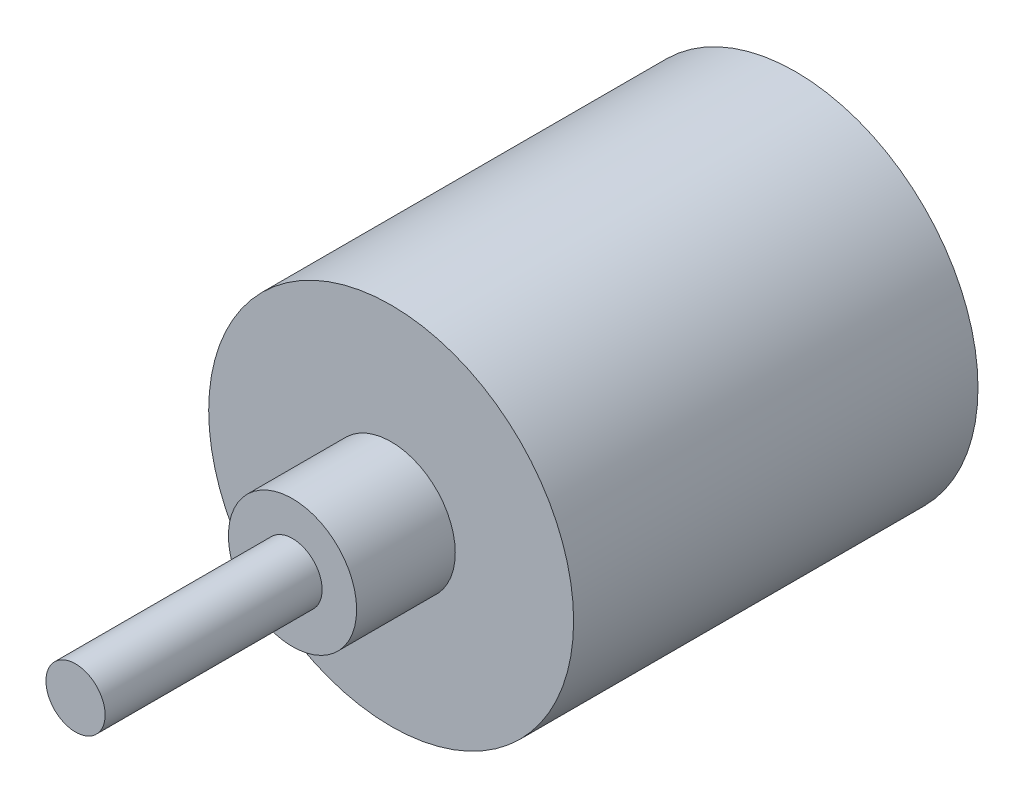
from build123d import *

# Parameters (mm, degrees)
SKETCH1_R           = 18.5
BOSS_EXTRUDE1_DEPTH = 41
SKETCH2_R           = 6.5
BOSS_EXTRUDE2_DEPTH = 10
SKETCH3_R           = 3
BOSS_EXTRUDE3_DEPTH = 22


with BuildPart() as part:
    # Sketch1 → Boss-Extrude1 (new body)
    with BuildSketch(Plane.XY):
        Circle(SKETCH1_R)
    extrude(amount=BOSS_EXTRUDE1_DEPTH)

    # Sketch2 → Boss-Extrude2 (add)
    with BuildSketch(Plane.XY.offset(41)):
        Circle(SKETCH2_R)
    extrude(amount=BOSS_EXTRUDE2_DEPTH)

    # Sketch3 → Boss-Extrude3 (add)
    with BuildSketch(Plane.XY.offset(51)):
        Circle(SKETCH3_R)
    extrude(amount=BOSS_EXTRUDE3_DEPTH)


solid = part.part
